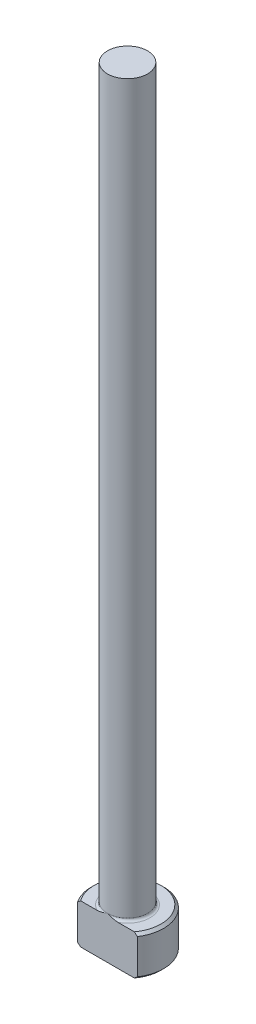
from build123d import *

# Parameters (mm, degrees)
CHAMFER1_SIZE = 0.254
FILLET1_R     = 0.254
KEY_DEPTH     = 77.366951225


with BuildPart() as part:
    # Sketch1 → Revolve1 (revolve)
    with BuildSketch(Plane.XY, mode=Mode.PRIVATE) as revolve1_sk:
        Polygon((0, 0), (-3.5687, 0), (-3.5687, 3.9624), (-1.98374, 3.9624), (-1.98374, 76.2), (0, 76.2), align=None)
    revolve(revolve1_sk.sketch.rotate(Axis((0, 259.958771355, 0), (0, -1, 0)), 270), axis=Axis((0, 259.958771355, 0), (0, -1, 0)))

    # Chamfer1
    chamfer1_edges = [part.edges().sort_by_distance(p)[0] for p in [
        (0, 3.9624, -3.5687),
        (0, 0, -3.5687),
    ]]
    chamfer(chamfer1_edges, length=CHAMFER1_SIZE)

    # Fillet1
    fillet1_edges = [part.edges().sort_by_distance(p)[0] for p in [
        (0, 3.9624, -1.98374),
    ]]
    fillet(fillet1_edges, radius=FILLET1_R)

    # Sketch2 → KEY (cut, through all)
    with BuildSketch(Plane.XZ):
        with BuildLine():
            Line((-2.966546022, 1.98374), (2.966546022, 1.98374))
            ThreePointArc((2.966546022, 1.98374), (0, 3.5687), (-2.966546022, 1.98374))
        make_face()
    extrude(amount=-KEY_DEPTH, mode=Mode.SUBTRACT)


solid = part.part
